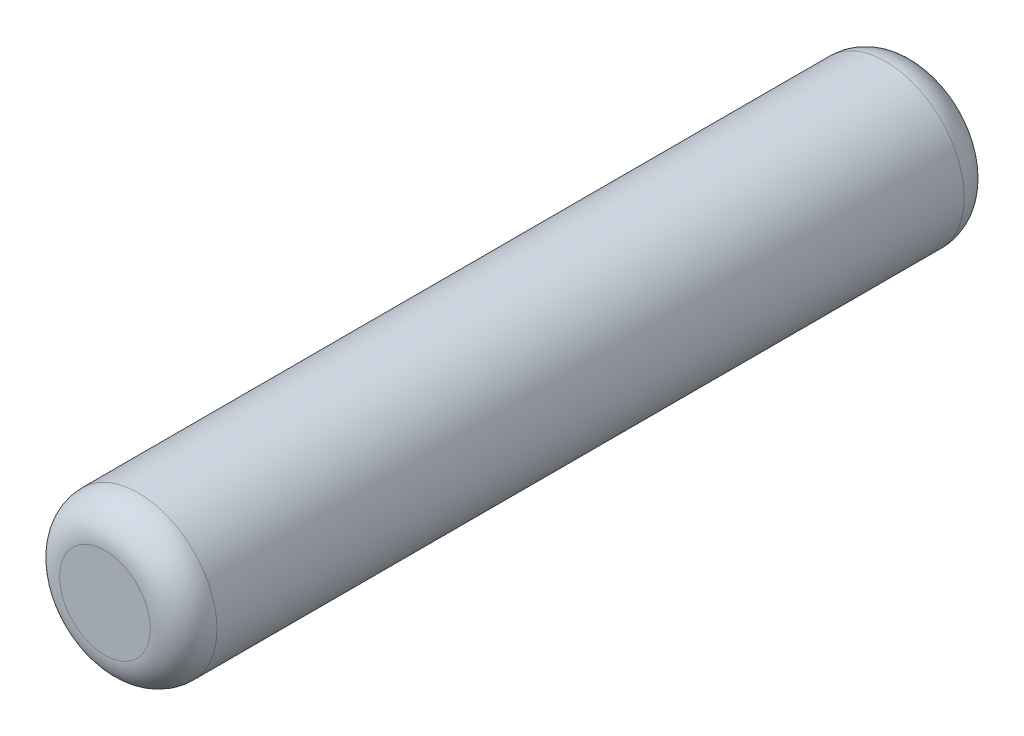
ISO-10303-21;
HEADER;
FILE_DESCRIPTION(('STEP AP214'),'2;1');
FILE_NAME('part.step','',(''),(''),'','','');
FILE_SCHEMA(('AUTOMOTIVE_DESIGN { 1 0 10303 214 1 1 1 1 }'));
ENDSEC;
DATA;
#1=APPLICATION_CONTEXT('core data for automotive mechanical design processes');
#2=APPLICATION_PROTOCOL_DEFINITION('international standard','automotive_design',2000,#1);
#3=PRODUCT_CONTEXT('',#1,'mechanical');
#4=PRODUCT('Part','Part','',(#3));
#5=PRODUCT_RELATED_PRODUCT_CATEGORY('part','',(#4));
#6=PRODUCT_DEFINITION_FORMATION('','',#4);
#7=PRODUCT_DEFINITION_CONTEXT('part definition',#1,'design');
#8=PRODUCT_DEFINITION('design','',#6,#7);
#9=PRODUCT_DEFINITION_SHAPE('','',#8);
#10=(LENGTH_UNIT() NAMED_UNIT(*) SI_UNIT(.MILLI.,.METRE.));
#11=(NAMED_UNIT(*) PLANE_ANGLE_UNIT() SI_UNIT($,.RADIAN.));
#12=(NAMED_UNIT(*) SI_UNIT($,.STERADIAN.) SOLID_ANGLE_UNIT());
#13=UNCERTAINTY_MEASURE_WITH_UNIT(LENGTH_MEASURE(1.E-05),#10,'distance_accuracy_value','');
#14=(GEOMETRIC_REPRESENTATION_CONTEXT(3) GLOBAL_UNCERTAINTY_ASSIGNED_CONTEXT((#13)) GLOBAL_UNIT_ASSIGNED_CONTEXT((#10,
#11,#12)) REPRESENTATION_CONTEXT('',''));
#15=CARTESIAN_POINT('',(0.,0.,0.));
#16=DIRECTION('',(0.,0.,1.));
#17=DIRECTION('',(1.,0.,0.));
#18=AXIS2_PLACEMENT_3D('',#15,#16,#17);
#19=CARTESIAN_POINT('',(0.,0.692149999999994,6.2103));
#20=DIRECTION('',(0.,0.,-1.));
#21=DIRECTION('',(-1.,0.,0.));
#22=AXIS2_PLACEMENT_3D('',#19,#20,#21);
#23=PLANE('',#22);
#24=CARTESIAN_POINT('',(0.,0.,6.2103));
#25=DIRECTION('',(0.,0.,1.));
#26=DIRECTION('',(1.,0.,0.));
#27=AXIS2_PLACEMENT_3D('',#24,#25,#26);
#28=CIRCLE('',#27,0.692149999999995);
#29=CARTESIAN_POINT('',(0.692149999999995,0.,6.2103));
#30=VERTEX_POINT('',#29);
#31=EDGE_CURVE('E47',#30,#30,#28,.T.);
#32=ORIENTED_EDGE('',*,*,#31,.T.);
#33=EDGE_LOOP('',(#32));
#34=FACE_BOUND('',#33,.T.);
#35=ADVANCED_FACE('F33',(#34),#23,.F.);
#36=CARTESIAN_POINT('',(0.,0.,-6.2103));
#37=DIRECTION('',(0.,0.,1.));
#38=DIRECTION('',(1.,0.,0.));
#39=AXIS2_PLACEMENT_3D('',#36,#37,#38);
#40=PLANE('',#39);
#41=CARTESIAN_POINT('',(0.,0.,-6.2103));
#42=DIRECTION('',(0.,0.,1.));
#43=DIRECTION('',(1.,0.,0.));
#44=AXIS2_PLACEMENT_3D('',#41,#42,#43);
#45=CIRCLE('',#44,0.692149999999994);
#46=CARTESIAN_POINT('',(0.692149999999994,0.,-6.2103));
#47=VERTEX_POINT('',#46);
#48=EDGE_CURVE('E10',#47,#47,#45,.T.);
#49=ORIENTED_EDGE('',*,*,#48,.F.);
#50=EDGE_LOOP('',(#49));
#51=FACE_BOUND('',#50,.T.);
#52=ADVANCED_FACE('F67',(#51),#40,.F.);
#53=CARTESIAN_POINT('',(0.,0.,-5.7023));
#54=DIRECTION('',(0.,0.,1.));
#55=DIRECTION('',(1.,0.,0.));
#56=AXIS2_PLACEMENT_3D('',#53,#54,#55);
#57=TOROIDAL_SURFACE('',#56,0.692149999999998,0.508);
#58=CARTESIAN_POINT('',(0.,0.,-5.70229999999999));
#59=DIRECTION('',(0.,0.,1.));
#60=DIRECTION('',(1.,0.,0.));
#61=AXIS2_PLACEMENT_3D('',#58,#59,#60);
#62=CIRCLE('',#61,1.20015);
#63=CARTESIAN_POINT('',(1.20015,0.,-5.70229999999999));
#64=VERTEX_POINT('',#63);
#65=EDGE_CURVE('E39',#64,#64,#62,.T.);
#66=ORIENTED_EDGE('',*,*,#65,.F.);
#67=EDGE_LOOP('',(#66));
#68=FACE_BOUND('',#67,.T.);
#69=ORIENTED_EDGE('',*,*,#48,.T.);
#70=EDGE_LOOP('',(#69));
#71=FACE_BOUND('',#70,.T.);
#72=ADVANCED_FACE('F62',(#68,#71),#57,.T.);
#73=CARTESIAN_POINT('',(0.,0.,35.4909912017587));
#74=DIRECTION('',(0.,0.,1.));
#75=DIRECTION('',(1.,0.,0.));
#76=AXIS2_PLACEMENT_3D('',#73,#74,#75);
#77=CYLINDRICAL_SURFACE('',#76,1.20015);
#78=CARTESIAN_POINT('',(0.,0.,5.70229999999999));
#79=DIRECTION('',(0.,0.,1.));
#80=DIRECTION('',(1.,0.,0.));
#81=AXIS2_PLACEMENT_3D('',#78,#79,#80);
#82=CIRCLE('',#81,1.20015);
#83=CARTESIAN_POINT('',(1.20015,0.,5.70229999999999));
#84=VERTEX_POINT('',#83);
#85=EDGE_CURVE('E43',#84,#84,#82,.T.);
#86=ORIENTED_EDGE('',*,*,#85,.F.);
#87=EDGE_LOOP('',(#86));
#88=FACE_BOUND('',#87,.T.);
#89=ORIENTED_EDGE('',*,*,#65,.T.);
#90=EDGE_LOOP('',(#89));
#91=FACE_BOUND('',#90,.T.);
#92=ADVANCED_FACE('F57',(#88,#91),#77,.T.);
#93=CARTESIAN_POINT('',(0.,0.,5.7023));
#94=DIRECTION('',(0.,0.,1.));
#95=DIRECTION('',(1.,0.,0.));
#96=AXIS2_PLACEMENT_3D('',#93,#94,#95);
#97=TOROIDAL_SURFACE('',#96,0.692149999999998,0.508);
#98=ORIENTED_EDGE('',*,*,#31,.F.);
#99=EDGE_LOOP('',(#98));
#100=FACE_BOUND('',#99,.T.);
#101=ORIENTED_EDGE('',*,*,#85,.T.);
#102=EDGE_LOOP('',(#101));
#103=FACE_BOUND('',#102,.T.);
#104=ADVANCED_FACE('F54',(#100,#103),#97,.T.);
#105=CLOSED_SHELL('',(#35,#52,#72,#92,#104));
#106=MANIFOLD_SOLID_BREP('B2',#105);
#107=ADVANCED_BREP_SHAPE_REPRESENTATION('',(#18,#106),#14);
#108=SHAPE_DEFINITION_REPRESENTATION(#9,#107);
ENDSEC;
END-ISO-10303-21;
